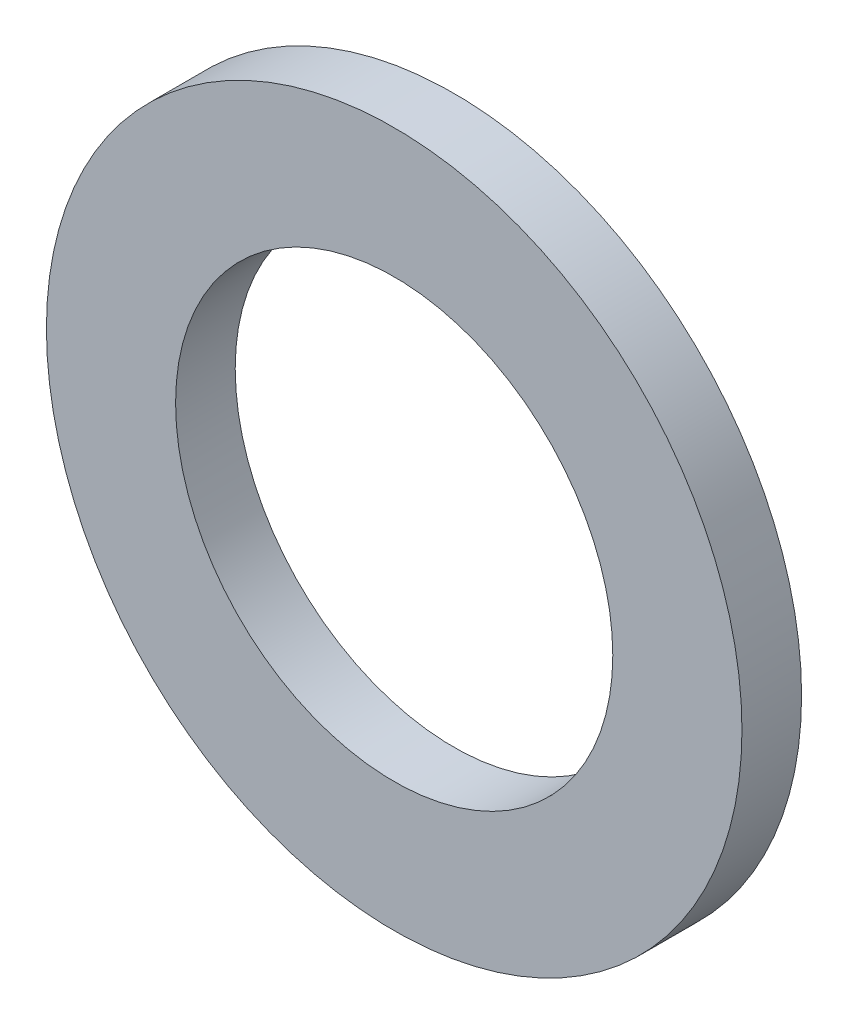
ISO-10303-21;
HEADER;
FILE_DESCRIPTION(('STEP AP214'),'2;1');
FILE_NAME('part.step','',(''),(''),'','','');
FILE_SCHEMA(('AUTOMOTIVE_DESIGN { 1 0 10303 214 1 1 1 1 }'));
ENDSEC;
DATA;
#1=APPLICATION_CONTEXT('core data for automotive mechanical design processes');
#2=APPLICATION_PROTOCOL_DEFINITION('international standard','automotive_design',2000,#1);
#3=PRODUCT_CONTEXT('',#1,'mechanical');
#4=PRODUCT('Part','Part','',(#3));
#5=PRODUCT_RELATED_PRODUCT_CATEGORY('part','',(#4));
#6=PRODUCT_DEFINITION_FORMATION('','',#4);
#7=PRODUCT_DEFINITION_CONTEXT('part definition',#1,'design');
#8=PRODUCT_DEFINITION('design','',#6,#7);
#9=PRODUCT_DEFINITION_SHAPE('','',#8);
#10=(LENGTH_UNIT() NAMED_UNIT(*) SI_UNIT(.MILLI.,.METRE.));
#11=(NAMED_UNIT(*) PLANE_ANGLE_UNIT() SI_UNIT($,.RADIAN.));
#12=(NAMED_UNIT(*) SI_UNIT($,.STERADIAN.) SOLID_ANGLE_UNIT());
#13=UNCERTAINTY_MEASURE_WITH_UNIT(LENGTH_MEASURE(1.E-05),#10,'distance_accuracy_value','');
#14=(GEOMETRIC_REPRESENTATION_CONTEXT(3) GLOBAL_UNCERTAINTY_ASSIGNED_CONTEXT((#13)) GLOBAL_UNIT_ASSIGNED_CONTEXT((#10,
#11,#12)) REPRESENTATION_CONTEXT('',''));
#15=CARTESIAN_POINT('',(0.,0.,0.));
#16=DIRECTION('',(0.,0.,1.));
#17=DIRECTION('',(1.,0.,0.));
#18=AXIS2_PLACEMENT_3D('',#15,#16,#17);
#19=CARTESIAN_POINT('',(0.,0.,3.));
#20=DIRECTION('',(0.,0.,1.));
#21=DIRECTION('',(1.,0.,0.));
#22=AXIS2_PLACEMENT_3D('',#19,#20,#21);
#23=PLANE('',#22);
#24=CARTESIAN_POINT('',(0.,0.,3.));
#25=DIRECTION('',(0.,0.,1.));
#26=DIRECTION('',(1.,0.,0.));
#27=AXIS2_PLACEMENT_3D('',#24,#25,#26);
#28=CIRCLE('',#27,17.5);
#29=CARTESIAN_POINT('',(17.5,0.,3.));
#30=VERTEX_POINT('',#29);
#31=EDGE_CURVE('E10',#30,#30,#28,.T.);
#32=ORIENTED_EDGE('',*,*,#31,.T.);
#33=EDGE_LOOP('',(#32));
#34=FACE_BOUND('',#33,.T.);
#35=CARTESIAN_POINT('',(0.,0.,3.));
#36=DIRECTION('',(0.,0.,1.));
#37=DIRECTION('',(1.,0.,0.));
#38=AXIS2_PLACEMENT_3D('',#35,#36,#37);
#39=CIRCLE('',#38,11.);
#40=CARTESIAN_POINT('',(11.,0.,3.));
#41=VERTEX_POINT('',#40);
#42=EDGE_CURVE('E43',#41,#41,#39,.T.);
#43=ORIENTED_EDGE('',*,*,#42,.F.);
#44=EDGE_LOOP('',(#43));
#45=FACE_BOUND('',#44,.T.);
#46=ADVANCED_FACE('F32',(#34,#45),#23,.T.);
#47=CARTESIAN_POINT('',(0.,0.,0.));
#48=DIRECTION('',(0.,0.,1.));
#49=DIRECTION('',(1.,0.,0.));
#50=AXIS2_PLACEMENT_3D('',#47,#48,#49);
#51=PLANE('',#50);
#52=CARTESIAN_POINT('',(0.,0.,0.));
#53=DIRECTION('',(0.,0.,1.));
#54=DIRECTION('',(1.,0.,0.));
#55=AXIS2_PLACEMENT_3D('',#52,#53,#54);
#56=CIRCLE('',#55,17.5);
#57=CARTESIAN_POINT('',(17.5,0.,0.));
#58=VERTEX_POINT('',#57);
#59=EDGE_CURVE('E39',#58,#58,#56,.T.);
#60=ORIENTED_EDGE('',*,*,#59,.F.);
#61=EDGE_LOOP('',(#60));
#62=FACE_BOUND('',#61,.T.);
#63=CARTESIAN_POINT('',(0.,0.,0.));
#64=DIRECTION('',(0.,0.,1.));
#65=DIRECTION('',(1.,0.,0.));
#66=AXIS2_PLACEMENT_3D('',#63,#64,#65);
#67=CIRCLE('',#66,11.);
#68=CARTESIAN_POINT('',(11.,0.,0.));
#69=VERTEX_POINT('',#68);
#70=EDGE_CURVE('E47',#69,#69,#67,.T.);
#71=ORIENTED_EDGE('',*,*,#70,.T.);
#72=EDGE_LOOP('',(#71));
#73=FACE_BOUND('',#72,.T.);
#74=ADVANCED_FACE('F53',(#62,#73),#51,.F.);
#75=CARTESIAN_POINT('',(0.,0.,3.));
#76=DIRECTION('',(0.,0.,-1.));
#77=DIRECTION('',(-1.,0.,0.));
#78=AXIS2_PLACEMENT_3D('',#75,#76,#77);
#79=CYLINDRICAL_SURFACE('',#78,17.5);
#80=ORIENTED_EDGE('',*,*,#31,.F.);
#81=EDGE_LOOP('',(#80));
#82=FACE_BOUND('',#81,.T.);
#83=ORIENTED_EDGE('',*,*,#59,.T.);
#84=EDGE_LOOP('',(#83));
#85=FACE_BOUND('',#84,.T.);
#86=ADVANCED_FACE('F34',(#82,#85),#79,.T.);
#87=CARTESIAN_POINT('',(0.,0.,3.));
#88=DIRECTION('',(0.,0.,-1.));
#89=DIRECTION('',(-1.,0.,0.));
#90=AXIS2_PLACEMENT_3D('',#87,#88,#89);
#91=CYLINDRICAL_SURFACE('',#90,11.);
#92=ORIENTED_EDGE('',*,*,#42,.T.);
#93=EDGE_LOOP('',(#92));
#94=FACE_BOUND('',#93,.T.);
#95=ORIENTED_EDGE('',*,*,#70,.F.);
#96=EDGE_LOOP('',(#95));
#97=FACE_BOUND('',#96,.T.);
#98=ADVANCED_FACE('F55',(#94,#97),#91,.F.);
#99=CLOSED_SHELL('',(#46,#74,#86,#98));
#100=MANIFOLD_SOLID_BREP('B2',#99);
#101=ADVANCED_BREP_SHAPE_REPRESENTATION('',(#18,#100),#14);
#102=SHAPE_DEFINITION_REPRESENTATION(#9,#101);
ENDSEC;
END-ISO-10303-21;
